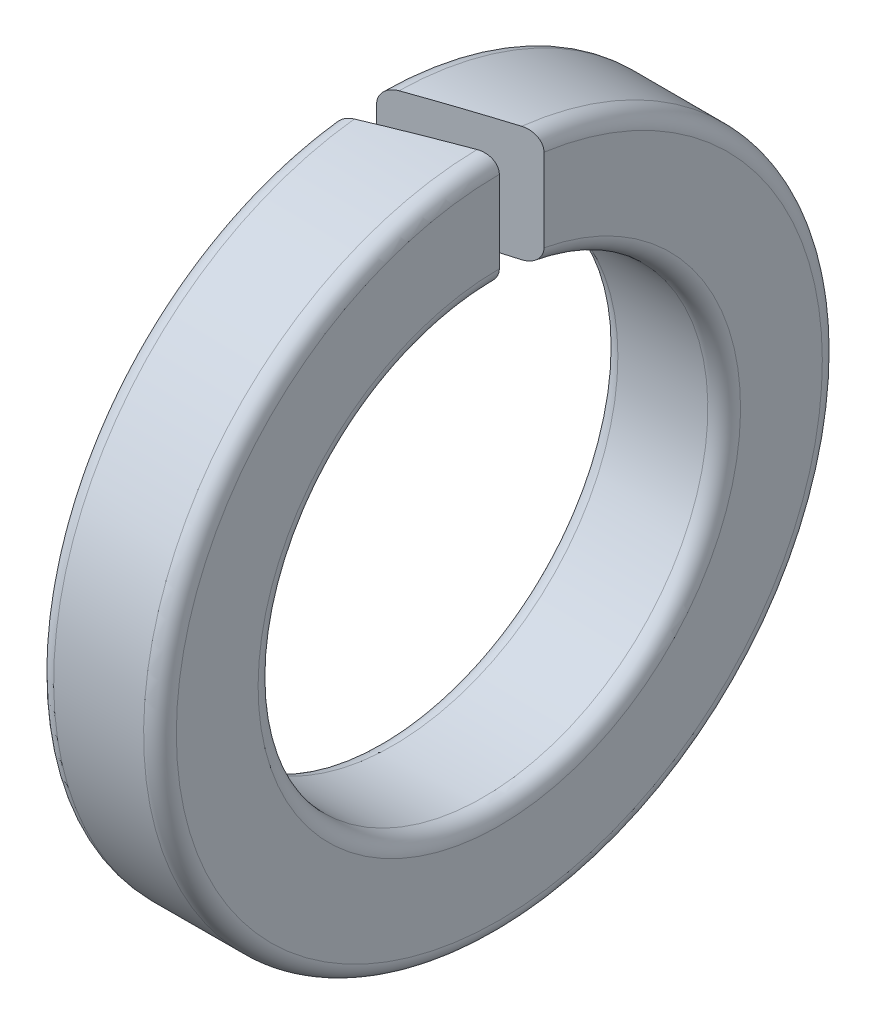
ISO-10303-21;
HEADER;
FILE_DESCRIPTION(('STEP AP214'),'2;1');
FILE_NAME('part.step','',(''),(''),'','','');
FILE_SCHEMA(('AUTOMOTIVE_DESIGN { 1 0 10303 214 1 1 1 1 }'));
ENDSEC;
DATA;
#1=APPLICATION_CONTEXT('core data for automotive mechanical design processes');
#2=APPLICATION_PROTOCOL_DEFINITION('international standard','automotive_design',2000,#1);
#3=PRODUCT_CONTEXT('',#1,'mechanical');
#4=PRODUCT('Part','Part','',(#3));
#5=PRODUCT_RELATED_PRODUCT_CATEGORY('part','',(#4));
#6=PRODUCT_DEFINITION_FORMATION('','',#4);
#7=PRODUCT_DEFINITION_CONTEXT('part definition',#1,'design');
#8=PRODUCT_DEFINITION('design','',#6,#7);
#9=PRODUCT_DEFINITION_SHAPE('','',#8);
#10=(LENGTH_UNIT() NAMED_UNIT(*) SI_UNIT(.MILLI.,.METRE.));
#11=(NAMED_UNIT(*) PLANE_ANGLE_UNIT() SI_UNIT($,.RADIAN.));
#12=(NAMED_UNIT(*) SI_UNIT($,.STERADIAN.) SOLID_ANGLE_UNIT());
#13=UNCERTAINTY_MEASURE_WITH_UNIT(LENGTH_MEASURE(1.E-05),#10,'distance_accuracy_value','');
#14=(GEOMETRIC_REPRESENTATION_CONTEXT(3) GLOBAL_UNCERTAINTY_ASSIGNED_CONTEXT((#13)) GLOBAL_UNIT_ASSIGNED_CONTEXT((#10,
#11,#12)) REPRESENTATION_CONTEXT('',''));
#15=CARTESIAN_POINT('',(0.,0.,0.));
#16=DIRECTION('',(0.,0.,1.));
#17=DIRECTION('',(1.,0.,0.));
#18=AXIS2_PLACEMENT_3D('',#15,#16,#17);
#19=CARTESIAN_POINT('',(0.,0.,-4.15));
#20=DIRECTION('',(1.,0.,0.));
#21=DIRECTION('',(0.,0.,-1.));
#22=AXIS2_PLACEMENT_3D('',#19,#20,#21);
#23=PLANE('',#22);
#24=DIRECTION('',(0.,-1.,0.));
#25=VECTOR('',#24,1.);
#26=CARTESIAN_POINT('',(0.,4.15,0.));
#27=LINE('',#26,#25);
#28=CARTESIAN_POINT('',(0.,3.95,0.));
#29=VERTEX_POINT('',#28);
#30=CARTESIAN_POINT('',(0.,2.95,0.));
#31=VERTEX_POINT('',#30);
#32=EDGE_CURVE('E206',#29,#31,#27,.T.);
#33=ORIENTED_EDGE('',*,*,#32,.F.);
#34=CARTESIAN_POINT('',(0.,0.,0.));
#35=DIRECTION('',(1.,0.,0.));
#36=DIRECTION('',(0.,0.,-1.));
#37=AXIS2_PLACEMENT_3D('',#34,#35,#36);
#38=CIRCLE('',#37,3.95);
#39=CARTESIAN_POINT('',(0.,3.91208802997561,0.545955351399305));
#40=VERTEX_POINT('',#39);
#41=EDGE_CURVE('E208',#29,#40,#38,.F.);
#42=ORIENTED_EDGE('',*,*,#41,.T.);
#43=DIRECTION('',(0.,-1.,0.));
#44=VECTOR('',#43,1.);
#45=CARTESIAN_POINT('',(0.,4.15,0.545955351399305));
#46=LINE('',#45,#44);
#47=CARTESIAN_POINT('',(0.,2.89903997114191,0.545955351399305));
#48=VERTEX_POINT('',#47);
#49=EDGE_CURVE('E104',#40,#48,#46,.T.);
#50=ORIENTED_EDGE('',*,*,#49,.T.);
#51=CARTESIAN_POINT('',(0.,0.,0.));
#52=DIRECTION('',(1.,0.,0.));
#53=DIRECTION('',(0.,0.,-1.));
#54=AXIS2_PLACEMENT_3D('',#51,#52,#53);
#55=CIRCLE('',#54,2.95);
#56=EDGE_CURVE('E49',#48,#31,#55,.T.);
#57=ORIENTED_EDGE('',*,*,#56,.T.);
#58=EDGE_LOOP('',(#33,#42,#50,#57));
#59=FACE_BOUND('',#58,.T.);
#60=ADVANCED_FACE('F35',(#59),#23,.F.);
#61=CARTESIAN_POINT('',(0.,0.,0.));
#62=DIRECTION('',(-1.,0.,0.));
#63=DIRECTION('',(0.,0.,1.));
#64=AXIS2_PLACEMENT_3D('',#61,#62,#63);
#65=CYLINDRICAL_SURFACE('',#64,2.75);
#66=CARTESIAN_POINT('',(1.5,0.,0.));
#67=DIRECTION('',(-0.342020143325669,0.,-0.939692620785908));
#68=DIRECTION('',(-0.939692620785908,0.,0.342020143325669));
#69=AXIS2_PLACEMENT_3D('',#66,#67,#68);
#70=ELLIPSE('',#69,8.04046210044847,2.75);
#71=CARTESIAN_POINT('',(1.3,2.74903638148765,0.072794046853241));
#72=VERTEX_POINT('',#71);
#73=CARTESIAN_POINT('',(0.2,2.70898844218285,0.473161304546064));
#74=VERTEX_POINT('',#73);
#75=EDGE_CURVE('E217',#72,#74,#70,.F.);
#76=ORIENTED_EDGE('',*,*,#75,.F.);
#77=CARTESIAN_POINT('',(1.3,0.,0.));
#78=DIRECTION('',(-1.,0.,0.));
#79=DIRECTION('',(0.,0.,1.));
#80=AXIS2_PLACEMENT_3D('',#77,#78,#79);
#81=CIRCLE('',#80,2.75);
#82=CARTESIAN_POINT('',(1.3,2.70898844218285,-0.473161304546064));
#83=VERTEX_POINT('',#82);
#84=EDGE_CURVE('E11',#72,#83,#81,.F.);
#85=ORIENTED_EDGE('',*,*,#84,.T.);
#86=CARTESIAN_POINT('',(0.,0.,0.));
#87=DIRECTION('',(0.34202014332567,0.,0.939692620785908));
#88=DIRECTION('',(-0.939692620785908,0.,0.342020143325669));
#89=AXIS2_PLACEMENT_3D('',#86,#87,#88);
#90=ELLIPSE('',#89,8.04046210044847,2.75);
#91=CARTESIAN_POINT('',(0.2,2.74903638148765,-0.0727940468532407));
#92=VERTEX_POINT('',#91);
#93=EDGE_CURVE('E219',#92,#83,#90,.F.);
#94=ORIENTED_EDGE('',*,*,#93,.F.);
#95=CARTESIAN_POINT('',(0.2,0.,0.));
#96=DIRECTION('',(1.,0.,0.));
#97=DIRECTION('',(0.,0.,-1.));
#98=AXIS2_PLACEMENT_3D('',#95,#96,#97);
#99=CIRCLE('',#98,2.75);
#100=EDGE_CURVE('E42',#92,#74,#99,.F.);
#101=ORIENTED_EDGE('',*,*,#100,.T.);
#102=EDGE_LOOP('',(#76,#85,#94,#101));
#103=FACE_BOUND('',#102,.T.);
#104=ADVANCED_FACE('F216',(#103),#65,.F.);
#105=CARTESIAN_POINT('',(1.5,0.,-4.15));
#106=DIRECTION('',(-1.,0.,0.));
#107=DIRECTION('',(0.,0.,1.));
#108=AXIS2_PLACEMENT_3D('',#105,#106,#107);
#109=PLANE('',#108);
#110=DIRECTION('',(0.,-1.,0.));
#111=VECTOR('',#110,1.);
#112=CARTESIAN_POINT('',(1.5,4.15,0.));
#113=LINE('',#112,#111);
#114=CARTESIAN_POINT('',(1.5,3.95,0.));
#115=VERTEX_POINT('',#114);
#116=CARTESIAN_POINT('',(1.5,2.95,0.));
#117=VERTEX_POINT('',#116);
#118=EDGE_CURVE('E201',#115,#117,#113,.T.);
#119=ORIENTED_EDGE('',*,*,#118,.F.);
#120=CARTESIAN_POINT('',(1.5,0.,0.));
#121=DIRECTION('',(-1.,0.,0.));
#122=DIRECTION('',(0.,0.,1.));
#123=AXIS2_PLACEMENT_3D('',#120,#121,#122);
#124=CIRCLE('',#123,3.95);
#125=CARTESIAN_POINT('',(1.5,3.91208802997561,-0.545955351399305));
#126=VERTEX_POINT('',#125);
#127=EDGE_CURVE('E156',#115,#126,#124,.F.);
#128=ORIENTED_EDGE('',*,*,#127,.T.);
#129=DIRECTION('',(0.,-1.,0.));
#130=VECTOR('',#129,1.);
#131=CARTESIAN_POINT('',(1.5,4.15,-0.545955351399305));
#132=LINE('',#131,#130);
#133=CARTESIAN_POINT('',(1.5,2.89903997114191,-0.545955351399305));
#134=VERTEX_POINT('',#133);
#135=EDGE_CURVE('E200',#126,#134,#132,.T.);
#136=ORIENTED_EDGE('',*,*,#135,.T.);
#137=CARTESIAN_POINT('',(1.5,0.,0.));
#138=DIRECTION('',(-1.,0.,0.));
#139=DIRECTION('',(0.,0.,1.));
#140=AXIS2_PLACEMENT_3D('',#137,#138,#139);
#141=CIRCLE('',#140,2.95);
#142=EDGE_CURVE('E190',#134,#117,#141,.T.);
#143=ORIENTED_EDGE('',*,*,#142,.T.);
#144=EDGE_LOOP('',(#119,#128,#136,#143));
#145=FACE_BOUND('',#144,.T.);
#146=ADVANCED_FACE('F199',(#145),#109,.F.);
#147=CARTESIAN_POINT('',(0.,0.,0.));
#148=DIRECTION('',(-1.,0.,0.));
#149=DIRECTION('',(0.,0.,1.));
#150=AXIS2_PLACEMENT_3D('',#147,#148,#149);
#151=CYLINDRICAL_SURFACE('',#150,4.15);
#152=CARTESIAN_POINT('',(0.,0.,0.));
#153=DIRECTION('',(0.34202014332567,0.,0.939692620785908));
#154=DIRECTION('',(-0.939692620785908,0.,0.342020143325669));
#155=AXIS2_PLACEMENT_3D('',#152,#153,#154);
#156=ELLIPSE('',#155,12.1337882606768,4.15);
#157=CARTESIAN_POINT('',(1.30000000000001,4.12293807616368,-0.473161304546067));
#158=VERTEX_POINT('',#157);
#159=CARTESIAN_POINT('',(0.200000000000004,4.14936152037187,-0.0727940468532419));
#160=VERTEX_POINT('',#159);
#161=EDGE_CURVE('E119',#158,#160,#156,.T.);
#162=ORIENTED_EDGE('',*,*,#161,.F.);
#163=CARTESIAN_POINT('',(1.3,0.,0.));
#164=DIRECTION('',(-1.,0.,0.));
#165=DIRECTION('',(0.,0.,1.));
#166=AXIS2_PLACEMENT_3D('',#163,#164,#165);
#167=CIRCLE('',#166,4.15);
#168=CARTESIAN_POINT('',(1.3,4.14936152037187,0.0727940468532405));
#169=VERTEX_POINT('',#168);
#170=EDGE_CURVE('E118',#158,#169,#167,.T.);
#171=ORIENTED_EDGE('',*,*,#170,.T.);
#172=CARTESIAN_POINT('',(1.5,0.,0.));
#173=DIRECTION('',(-0.342020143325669,0.,-0.939692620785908));
#174=DIRECTION('',(-0.939692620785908,0.,0.342020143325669));
#175=AXIS2_PLACEMENT_3D('',#172,#173,#174);
#176=ELLIPSE('',#175,12.1337882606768,4.15);
#177=CARTESIAN_POINT('',(0.2,4.12293807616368,0.473161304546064));
#178=VERTEX_POINT('',#177);
#179=EDGE_CURVE('E103',#178,#169,#176,.T.);
#180=ORIENTED_EDGE('',*,*,#179,.F.);
#181=CARTESIAN_POINT('',(0.2,0.,0.));
#182=DIRECTION('',(1.,0.,0.));
#183=DIRECTION('',(0.,0.,-1.));
#184=AXIS2_PLACEMENT_3D('',#181,#182,#183);
#185=CIRCLE('',#184,4.15);
#186=EDGE_CURVE('E116',#178,#160,#185,.T.);
#187=ORIENTED_EDGE('',*,*,#186,.T.);
#188=EDGE_LOOP('',(#162,#171,#180,#187));
#189=FACE_BOUND('',#188,.T.);
#190=ADVANCED_FACE('F115',(#189),#151,.T.);
#191=CARTESIAN_POINT('',(0.,4.15,0.));
#192=DIRECTION('',(0.34202014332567,0.,0.939692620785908));
#193=DIRECTION('',(0.939692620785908,0.,-0.34202014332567));
#194=AXIS2_PLACEMENT_3D('',#191,#192,#193);
#195=PLANE('',#194);
#196=ORIENTED_EDGE('',*,*,#135,.F.);
#197=CARTESIAN_POINT('',(1.5,3.91208802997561,-0.545955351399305));
#198=CARTESIAN_POINT('',(1.50000966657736,3.92339249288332,-0.545958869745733));
#199=CARTESIAN_POINT('',(1.4990608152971,3.93468237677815,-0.545613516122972));
#200=CARTESIAN_POINT('',(1.49537612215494,3.95689178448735,-0.544272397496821));
#201=CARTESIAN_POINT('',(1.49264601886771,3.96781237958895,-0.543278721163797));
#202=CARTESIAN_POINT('',(1.48553100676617,3.98900741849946,-0.540689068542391));
#203=CARTESIAN_POINT('',(1.48114781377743,3.99928251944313,-0.539093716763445));
#204=CARTESIAN_POINT('',(1.47089451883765,4.01895953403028,-0.535361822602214));
#205=CARTESIAN_POINT('',(1.46502348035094,4.0283608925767,-0.533224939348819));
#206=CARTESIAN_POINT('',(1.45167297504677,4.0464983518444,-0.528365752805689));
#207=CARTESIAN_POINT('',(1.44413054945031,4.05518192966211,-0.525620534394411));
#208=CARTESIAN_POINT('',(1.42784747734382,4.07116829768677,-0.519693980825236));
#209=CARTESIAN_POINT('',(1.41910642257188,4.07847061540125,-0.51651249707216));
#210=CARTESIAN_POINT('',(1.40014122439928,4.09190655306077,-0.509609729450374));
#211=CARTESIAN_POINT('',(1.38986119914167,4.09795086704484,-0.505868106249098));
#212=CARTESIAN_POINT('',(1.36851523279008,4.10817313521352,-0.498098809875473));
#213=CARTESIAN_POINT('',(1.35744967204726,4.11235198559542,-0.494071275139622));
#214=CARTESIAN_POINT('',(1.3386044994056,4.1176692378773,-0.487212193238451));
#215=CARTESIAN_POINT('',(1.33095781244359,4.11935672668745,-0.484429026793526));
#216=CARTESIAN_POINT('',(1.31554764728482,4.12182816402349,-0.478820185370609));
#217=CARTESIAN_POINT('',(1.30778434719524,4.12261337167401,-0.475994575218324));
#218=CARTESIAN_POINT('',(1.30000000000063,4.12293807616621,-0.473161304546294));
#219=B_SPLINE_CURVE_WITH_KNOTS('',3,(#197,#198,#199,#200,#201,#202,#203,#204,#205,#206,#207,
#208,#209,#210,#211,#212,#213,#214,#215,#216,#217,#218),.UNSPECIFIED.,.F.,.F.,(4,2,2,2,2,2,2,2,
2,2,4),(0.,0.0338468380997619,0.0675851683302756,0.101288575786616,0.135013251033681,
0.170333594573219,0.205665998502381,0.242994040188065,0.280304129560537,0.305189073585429,
0.330039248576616),.UNSPECIFIED.);
#220=EDGE_CURVE('E175',#126,#158,#219,.T.);
#221=ORIENTED_EDGE('',*,*,#220,.T.);
#222=ORIENTED_EDGE('',*,*,#161,.T.);
#223=CARTESIAN_POINT('',(0.2,4.14936152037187,-0.0727940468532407));
#224=CARTESIAN_POINT('',(0.188298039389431,4.14944367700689,-0.068534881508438));
#225=CARTESIAN_POINT('',(0.176588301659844,4.14847752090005,-0.0642728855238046));
#226=CARTESIAN_POINT('',(0.153469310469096,4.14449002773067,-0.0558582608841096));
#227=CARTESIAN_POINT('',(0.142060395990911,4.14146646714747,-0.0517057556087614));
#228=CARTESIAN_POINT('',(0.119873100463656,4.13340098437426,-0.0436302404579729));
#229=CARTESIAN_POINT('',(0.109095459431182,4.12835674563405,-0.0397074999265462));
#230=CARTESIAN_POINT('',(0.0885299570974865,4.11635779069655,-0.0322222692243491));
#231=CARTESIAN_POINT('',(0.0787414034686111,4.10940442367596,-0.02865952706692));
#232=CARTESIAN_POINT('',(0.0607675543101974,4.09399164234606,-0.0221175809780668));
#233=CARTESIAN_POINT('',(0.052542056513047,4.0855854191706,-0.0191237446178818));
#234=CARTESIAN_POINT('',(0.0376283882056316,4.06734189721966,-0.0136956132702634));
#235=CARTESIAN_POINT('',(0.0309402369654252,4.05750458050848,-0.0112613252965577));
#236=CARTESIAN_POINT('',(0.0196992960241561,4.03727611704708,-0.00716995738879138));
#237=CARTESIAN_POINT('',(0.0150477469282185,4.02694701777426,-0.00547693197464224));
#238=CARTESIAN_POINT('',(0.00754588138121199,4.00557964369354,-0.00274647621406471));
#239=CARTESIAN_POINT('',(0.00469296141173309,3.9945424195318,-0.00170809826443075));
#240=CARTESIAN_POINT('',(0.00186695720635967,3.9778316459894,-0.000679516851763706));
#241=CARTESIAN_POINT('',(0.00116717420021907,3.97228758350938,-0.000424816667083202));
#242=CARTESIAN_POINT('',(0.000233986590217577,3.96116334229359,-8.51641540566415E-05));
#243=CARTESIAN_POINT('',(-9.60208021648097E-08,3.95558322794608,3.4948713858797E-08));
#244=CARTESIAN_POINT('',(0.,3.95000000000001,0.));
#245=B_SPLINE_CURVE_WITH_KNOTS('',3,(#223,#224,#225,#226,#227,#228,#229,#230,#231,#232,#233,
#234,#235,#236,#237,#238,#239,#240,#241,#242,#243,#244),.UNSPECIFIED.,.F.,.F.,(4,2,2,2,2,2,2,2,
2,2,4),(0.,0.0373199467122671,0.0746802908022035,0.112083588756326,0.149460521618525,
0.185682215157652,0.221904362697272,0.256094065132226,0.290234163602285,0.306996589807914,
0.323734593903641),.UNSPECIFIED.);
#246=EDGE_CURVE('E56',#160,#29,#245,.T.);
#247=ORIENTED_EDGE('',*,*,#246,.T.);
#248=ORIENTED_EDGE('',*,*,#32,.T.);
#249=CARTESIAN_POINT('',(0.,2.95,0.));
#250=CARTESIAN_POINT('',(-1.17208001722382E-05,2.93922821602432,4.26602238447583E-06));
#251=CARTESIAN_POINT('',(0.000869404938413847,2.92846340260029,-0.000316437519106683));
#252=CARTESIAN_POINT('',(0.00432644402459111,2.90727362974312,-0.00157469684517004));
#253=CARTESIAN_POINT('',(0.00689803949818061,2.89684787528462,-0.00251068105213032));
#254=CARTESIAN_POINT('',(0.0136454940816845,2.87660562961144,-0.0049665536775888));
#255=CARTESIAN_POINT('',(0.0178211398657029,2.86678905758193,-0.00648636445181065));
#256=CARTESIAN_POINT('',(0.0276221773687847,2.84801260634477,-0.0100536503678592));
#257=CARTESIAN_POINT('',(0.0332480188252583,2.839052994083,-0.0121012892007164));
#258=CARTESIAN_POINT('',(0.0459306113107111,2.82197256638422,-0.0167173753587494));
#259=CARTESIAN_POINT('',(0.0530216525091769,2.81388064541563,-0.0192983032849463));
#260=CARTESIAN_POINT('',(0.0683124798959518,2.79898685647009,-0.0248637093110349));
#261=CARTESIAN_POINT('',(0.076512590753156,2.79218536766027,-0.0278483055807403));
#262=CARTESIAN_POINT('',(0.0943342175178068,2.77961211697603,-0.0343348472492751));
#263=CARTESIAN_POINT('',(0.104012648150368,2.7739317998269,-0.0378575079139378));
#264=CARTESIAN_POINT('',(0.124090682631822,2.76426518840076,-0.0451653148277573));
#265=CARTESIAN_POINT('',(0.134490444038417,2.76027926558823,-0.0489505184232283));
#266=CARTESIAN_POINT('',(0.154052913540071,2.7545588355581,-0.0560706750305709));
#267=CARTESIAN_POINT('',(0.163150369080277,2.75256758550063,-0.0593818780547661));
#268=CARTESIAN_POINT('',(0.181496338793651,2.74985122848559,-0.0660592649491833));
#269=CARTESIAN_POINT('',(0.190744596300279,2.74912415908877,-0.069425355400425));
#270=CARTESIAN_POINT('',(0.2,2.74903638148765,-0.0727940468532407));
#271=B_SPLINE_CURVE_WITH_KNOTS('',3,(#249,#250,#251,#252,#253,#254,#255,#256,#257,#258,#259,
#260,#261,#262,#263,#264,#265,#266,#267,#268,#269,#270),.UNSPECIFIED.,.F.,.F.,(4,2,2,2,2,2,2,2,
2,2,4),(0.,0.0322638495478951,0.0644456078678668,0.0966230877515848,0.12881055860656,
0.161860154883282,0.194919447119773,0.230054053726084,0.265196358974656,0.294767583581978,
0.324292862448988),.UNSPECIFIED.);
#272=EDGE_CURVE('E149',#31,#92,#271,.T.);
#273=ORIENTED_EDGE('',*,*,#272,.T.);
#274=ORIENTED_EDGE('',*,*,#93,.T.);
#275=CARTESIAN_POINT('',(1.3,2.70898844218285,-0.473161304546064));
#276=CARTESIAN_POINT('',(1.31126923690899,2.70826441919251,-0.47726297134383));
#277=CARTESIAN_POINT('',(1.32260425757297,2.70850884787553,-0.481388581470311));
#278=CARTESIAN_POINT('',(1.34511715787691,2.71097147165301,-0.489582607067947));
#279=CARTESIAN_POINT('',(1.35629444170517,2.71319578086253,-0.493650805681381));
#280=CARTESIAN_POINT('',(1.37815677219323,2.71966808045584,-0.501608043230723));
#281=CARTESIAN_POINT('',(1.38884050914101,2.72392115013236,-0.505496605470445));
#282=CARTESIAN_POINT('',(1.4093015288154,2.73440270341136,-0.512943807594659));
#283=CARTESIAN_POINT('',(1.41908018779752,2.74062812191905,-0.516502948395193));
#284=CARTESIAN_POINT('',(1.43678078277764,2.75445843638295,-0.522945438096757));
#285=CARTESIAN_POINT('',(1.44478171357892,2.76194875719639,-0.525857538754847));
#286=CARTESIAN_POINT('',(1.45938534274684,2.77834355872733,-0.531172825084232));
#287=CARTESIAN_POINT('',(1.46598826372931,2.78724781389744,-0.53357609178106));
#288=CARTESIAN_POINT('',(1.47717939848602,2.80557203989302,-0.537649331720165));
#289=CARTESIAN_POINT('',(1.48187046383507,2.81492116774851,-0.539356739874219));
#290=CARTESIAN_POINT('',(1.48968510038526,2.83433429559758,-0.542201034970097));
#291=CARTESIAN_POINT('',(1.49280908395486,2.84439810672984,-0.543338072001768));
#292=CARTESIAN_POINT('',(1.49674800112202,2.86193049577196,-0.544771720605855));
#293=CARTESIAN_POINT('',(1.49797079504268,2.86929892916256,-0.545216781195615));
#294=CARTESIAN_POINT('',(1.49959694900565,2.88412459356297,-0.545808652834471));
#295=CARTESIAN_POINT('',(1.50000174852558,2.89158164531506,-0.545955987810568));
#296=CARTESIAN_POINT('',(1.50000000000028,2.89903997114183,-0.545955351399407));
#297=B_SPLINE_CURVE_WITH_KNOTS('',3,(#275,#276,#277,#278,#279,#280,#281,#282,#283,#284,#285,
#286,#287,#288,#289,#290,#291,#292,#293,#294,#295,#296),.UNSPECIFIED.,.F.,.F.,(4,2,2,2,2,2,2,2,
2,2,4),(0.,0.036023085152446,0.0721578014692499,0.108383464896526,0.144553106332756,
0.178394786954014,0.212231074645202,0.243874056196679,0.275508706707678,0.297907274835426,
0.320266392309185),.UNSPECIFIED.);
#298=EDGE_CURVE('E155',#83,#134,#297,.T.);
#299=ORIENTED_EDGE('',*,*,#298,.T.);
#300=EDGE_LOOP('',(#196,#221,#222,#247,#248,#273,#274,#299));
#301=FACE_BOUND('',#300,.T.);
#302=ADVANCED_FACE('F162',(#301),#195,.T.);
#303=CARTESIAN_POINT('',(1.5,4.15,0.));
#304=DIRECTION('',(-0.342020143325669,0.,-0.939692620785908));
#305=DIRECTION('',(-0.939692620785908,0.,0.342020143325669));
#306=AXIS2_PLACEMENT_3D('',#303,#304,#305);
#307=PLANE('',#306);
#308=ORIENTED_EDGE('',*,*,#179,.T.);
#309=CARTESIAN_POINT('',(1.3,4.14936152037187,0.0727940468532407));
#310=CARTESIAN_POINT('',(1.31170196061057,4.14944367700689,0.0685348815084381));
#311=CARTESIAN_POINT('',(1.32341169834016,4.14847752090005,0.0642728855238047));
#312=CARTESIAN_POINT('',(1.3465306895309,4.14449002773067,0.0558582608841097));
#313=CARTESIAN_POINT('',(1.35793960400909,4.14146646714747,0.0517057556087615));
#314=CARTESIAN_POINT('',(1.38012689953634,4.13340098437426,0.043630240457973));
#315=CARTESIAN_POINT('',(1.39090454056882,4.12835674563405,0.0397074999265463));
#316=CARTESIAN_POINT('',(1.41147004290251,4.11635779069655,0.0322222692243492));
#317=CARTESIAN_POINT('',(1.42125859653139,4.10940442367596,0.0286595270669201));
#318=CARTESIAN_POINT('',(1.4392324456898,4.09399164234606,0.0221175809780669));
#319=CARTESIAN_POINT('',(1.44745794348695,4.0855854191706,0.0191237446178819));
#320=CARTESIAN_POINT('',(1.46237161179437,4.06734189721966,0.0136956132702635));
#321=CARTESIAN_POINT('',(1.46905976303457,4.05750458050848,0.0112613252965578));
#322=CARTESIAN_POINT('',(1.48030070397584,4.03727611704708,0.00716995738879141));
#323=CARTESIAN_POINT('',(1.48495225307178,4.02694701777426,0.00547693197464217));
#324=CARTESIAN_POINT('',(1.49245411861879,4.00557964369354,0.00274647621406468));
#325=CARTESIAN_POINT('',(1.49530703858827,3.99454241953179,0.00170809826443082));
#326=CARTESIAN_POINT('',(1.49813304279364,3.9778316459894,0.00067951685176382));
#327=CARTESIAN_POINT('',(1.49883282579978,3.97228758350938,0.00042481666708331));
#328=CARTESIAN_POINT('',(1.49976601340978,3.96116334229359,8.51641540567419E-05));
#329=CARTESIAN_POINT('',(1.5000000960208,3.95558322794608,-3.49487137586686E-08));
#330=CARTESIAN_POINT('',(1.50000000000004,3.95000000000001,0.));
#331=B_SPLINE_CURVE_WITH_KNOTS('',3,(#309,#310,#311,#312,#313,#314,#315,#316,#317,#318,#319,
#320,#321,#322,#323,#324,#325,#326,#327,#328,#329,#330),.UNSPECIFIED.,.F.,.F.,(4,2,2,2,2,2,2,2,
2,2,4),(0.,0.037319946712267,0.0746802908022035,0.112083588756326,0.149460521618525,
0.185682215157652,0.221904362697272,0.256094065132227,0.290234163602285,0.306996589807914,
0.323734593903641),.UNSPECIFIED.);
#332=EDGE_CURVE('E109',#169,#115,#331,.T.);
#333=ORIENTED_EDGE('',*,*,#332,.T.);
#334=ORIENTED_EDGE('',*,*,#118,.T.);
#335=CARTESIAN_POINT('',(1.5,2.95,0.));
#336=CARTESIAN_POINT('',(1.50001172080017,2.93922821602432,-4.26602238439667E-06));
#337=CARTESIAN_POINT('',(1.49913059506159,2.92846340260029,0.000316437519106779));
#338=CARTESIAN_POINT('',(1.49567355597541,2.90727362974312,0.00157469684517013));
#339=CARTESIAN_POINT('',(1.49310196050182,2.89684787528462,0.00251068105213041));
#340=CARTESIAN_POINT('',(1.48635450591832,2.87660562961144,0.0049665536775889));
#341=CARTESIAN_POINT('',(1.4821788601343,2.86678905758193,0.00648636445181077));
#342=CARTESIAN_POINT('',(1.47237782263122,2.84801260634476,0.0100536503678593));
#343=CARTESIAN_POINT('',(1.46675198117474,2.839052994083,0.0121012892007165));
#344=CARTESIAN_POINT('',(1.45406938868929,2.82197256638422,0.0167173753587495));
#345=CARTESIAN_POINT('',(1.44697834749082,2.81388064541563,0.0192983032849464));
#346=CARTESIAN_POINT('',(1.43168752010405,2.79898685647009,0.024863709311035));
#347=CARTESIAN_POINT('',(1.42348740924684,2.79218536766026,0.0278483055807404));
#348=CARTESIAN_POINT('',(1.40566578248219,2.77961211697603,0.0343348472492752));
#349=CARTESIAN_POINT('',(1.39598735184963,2.7739317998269,0.0378575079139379));
#350=CARTESIAN_POINT('',(1.37590931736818,2.76426518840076,0.0451653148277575));
#351=CARTESIAN_POINT('',(1.36550955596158,2.76027926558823,0.0489505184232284));
#352=CARTESIAN_POINT('',(1.34594708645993,2.7545588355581,0.0560706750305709));
#353=CARTESIAN_POINT('',(1.33684963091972,2.75256758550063,0.0593818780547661));
#354=CARTESIAN_POINT('',(1.31850366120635,2.74985122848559,0.0660592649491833));
#355=CARTESIAN_POINT('',(1.30925540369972,2.74912415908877,0.069425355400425));
#356=CARTESIAN_POINT('',(1.3,2.74903638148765,0.0727940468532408));
#357=B_SPLINE_CURVE_WITH_KNOTS('',3,(#335,#336,#337,#338,#339,#340,#341,#342,#343,#344,#345,
#346,#347,#348,#349,#350,#351,#352,#353,#354,#355,#356),.UNSPECIFIED.,.F.,.F.,(4,2,2,2,2,2,2,2,
2,2,4),(0.,0.0322638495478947,0.0644456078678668,0.0966230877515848,0.128810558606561,
0.161860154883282,0.194919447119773,0.230054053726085,0.265196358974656,0.294767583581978,
0.324292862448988),.UNSPECIFIED.);
#358=EDGE_CURVE('E110',#117,#72,#357,.T.);
#359=ORIENTED_EDGE('',*,*,#358,.T.);
#360=ORIENTED_EDGE('',*,*,#75,.T.);
#361=CARTESIAN_POINT('',(0.2,2.70898844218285,0.473161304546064));
#362=CARTESIAN_POINT('',(0.188730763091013,2.70826441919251,0.47726297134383));
#363=CARTESIAN_POINT('',(0.177395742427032,2.70850884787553,0.481388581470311));
#364=CARTESIAN_POINT('',(0.154882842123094,2.71097147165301,0.489582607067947));
#365=CARTESIAN_POINT('',(0.143705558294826,2.71319578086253,0.493650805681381));
#366=CARTESIAN_POINT('',(0.121843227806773,2.71966808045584,0.501608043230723));
#367=CARTESIAN_POINT('',(0.111159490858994,2.72392115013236,0.505496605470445));
#368=CARTESIAN_POINT('',(0.0906984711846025,2.73440270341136,0.512943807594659));
#369=CARTESIAN_POINT('',(0.0809198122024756,2.74062812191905,0.516502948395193));
#370=CARTESIAN_POINT('',(0.0632192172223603,2.75445843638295,0.522945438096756));
#371=CARTESIAN_POINT('',(0.055218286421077,2.76194875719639,0.525857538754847));
#372=CARTESIAN_POINT('',(0.0406146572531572,2.77834355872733,0.531172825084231));
#373=CARTESIAN_POINT('',(0.0340117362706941,2.78724781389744,0.53357609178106));
#374=CARTESIAN_POINT('',(0.0228206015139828,2.80557203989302,0.537649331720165));
#375=CARTESIAN_POINT('',(0.018129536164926,2.81492116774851,0.539356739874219));
#376=CARTESIAN_POINT('',(0.0103148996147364,2.83433429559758,0.542201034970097));
#377=CARTESIAN_POINT('',(0.00719091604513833,2.84439810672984,0.543338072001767));
#378=CARTESIAN_POINT('',(0.0032519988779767,2.86193049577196,0.544771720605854));
#379=CARTESIAN_POINT('',(0.00202920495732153,2.86929892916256,0.545216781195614));
#380=CARTESIAN_POINT('',(0.000403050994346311,2.88412459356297,0.545808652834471));
#381=CARTESIAN_POINT('',(-1.74852557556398E-06,2.89158164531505,0.545955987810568));
#382=CARTESIAN_POINT('',(-2.79784474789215E-13,2.89903997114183,0.545955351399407));
#383=B_SPLINE_CURVE_WITH_KNOTS('',3,(#361,#362,#363,#364,#365,#366,#367,#368,#369,#370,#371,
#372,#373,#374,#375,#376,#377,#378,#379,#380,#381,#382),.UNSPECIFIED.,.F.,.F.,(4,2,2,2,2,2,2,2,
2,2,4),(0.,0.036023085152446,0.0721578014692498,0.108383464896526,0.144553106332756,
0.178394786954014,0.212231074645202,0.243874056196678,0.275508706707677,0.297907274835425,
0.320266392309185),.UNSPECIFIED.);
#384=EDGE_CURVE('E123',#74,#48,#383,.T.);
#385=ORIENTED_EDGE('',*,*,#384,.T.);
#386=ORIENTED_EDGE('',*,*,#49,.F.);
#387=CARTESIAN_POINT('',(0.,3.91208802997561,0.545955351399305));
#388=CARTESIAN_POINT('',(-9.6665773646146E-06,3.92339249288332,0.545958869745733));
#389=CARTESIAN_POINT('',(0.000939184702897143,3.93468237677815,0.545613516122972));
#390=CARTESIAN_POINT('',(0.00462387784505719,3.95689178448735,0.544272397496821));
#391=CARTESIAN_POINT('',(0.00735398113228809,3.96781237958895,0.543278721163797));
#392=CARTESIAN_POINT('',(0.0144689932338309,3.98900741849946,0.540689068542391));
#393=CARTESIAN_POINT('',(0.0188521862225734,3.99928251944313,0.539093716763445));
#394=CARTESIAN_POINT('',(0.0291054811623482,4.01895953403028,0.535361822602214));
#395=CARTESIAN_POINT('',(0.0349765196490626,4.0283608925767,0.533224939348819));
#396=CARTESIAN_POINT('',(0.0483270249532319,4.0464983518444,0.528365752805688));
#397=CARTESIAN_POINT('',(0.0558694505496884,4.05518192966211,0.525620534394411));
#398=CARTESIAN_POINT('',(0.0721525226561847,4.07116829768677,0.519693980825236));
#399=CARTESIAN_POINT('',(0.0808935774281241,4.07847061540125,0.516512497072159));
#400=CARTESIAN_POINT('',(0.0998587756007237,4.09190655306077,0.509609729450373));
#401=CARTESIAN_POINT('',(0.110138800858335,4.09795086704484,0.505868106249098));
#402=CARTESIAN_POINT('',(0.13148476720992,4.10817313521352,0.498098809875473));
#403=CARTESIAN_POINT('',(0.142550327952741,4.11235198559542,0.494071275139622));
#404=CARTESIAN_POINT('',(0.161395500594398,4.1176692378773,0.487212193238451));
#405=CARTESIAN_POINT('',(0.169042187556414,4.11935672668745,0.484429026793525));
#406=CARTESIAN_POINT('',(0.184452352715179,4.12182816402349,0.478820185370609));
#407=CARTESIAN_POINT('',(0.192215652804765,4.12261337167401,0.475994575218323));
#408=CARTESIAN_POINT('',(0.19999999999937,4.12293807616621,0.473161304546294));
#409=B_SPLINE_CURVE_WITH_KNOTS('',3,(#387,#388,#389,#390,#391,#392,#393,#394,#395,#396,#397,
#398,#399,#400,#401,#402,#403,#404,#405,#406,#407,#408),.UNSPECIFIED.,.F.,.F.,(4,2,2,2,2,2,2,2,
2,2,4),(0.,0.0338468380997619,0.0675851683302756,0.101288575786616,0.13501325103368,
0.170333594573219,0.205665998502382,0.242994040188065,0.280304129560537,0.305189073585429,
0.330039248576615),.UNSPECIFIED.);
#410=EDGE_CURVE('E100',#40,#178,#409,.T.);
#411=ORIENTED_EDGE('',*,*,#410,.T.);
#412=EDGE_LOOP('',(#308,#333,#334,#359,#360,#385,#386,#411));
#413=FACE_BOUND('',#412,.T.);
#414=ADVANCED_FACE('F102',(#413),#307,.T.);
#415=CARTESIAN_POINT('',(1.3,0.,0.));
#416=DIRECTION('',(-1.,0.,0.));
#417=DIRECTION('',(0.,0.,1.));
#418=AXIS2_PLACEMENT_3D('',#415,#416,#417);
#419=TOROIDAL_SURFACE('',#418,3.95,0.2);
#420=ORIENTED_EDGE('',*,*,#220,.F.);
#421=ORIENTED_EDGE('',*,*,#127,.F.);
#422=ORIENTED_EDGE('',*,*,#332,.F.);
#423=ORIENTED_EDGE('',*,*,#170,.F.);
#424=EDGE_LOOP('',(#420,#421,#422,#423));
#425=FACE_BOUND('',#424,.T.);
#426=ADVANCED_FACE('F166',(#425),#419,.T.);
#427=CARTESIAN_POINT('',(0.2,0.,0.));
#428=DIRECTION('',(1.,0.,0.));
#429=DIRECTION('',(0.,0.,-1.));
#430=AXIS2_PLACEMENT_3D('',#427,#428,#429);
#431=TOROIDAL_SURFACE('',#430,3.95,0.2);
#432=ORIENTED_EDGE('',*,*,#246,.F.);
#433=ORIENTED_EDGE('',*,*,#186,.F.);
#434=ORIENTED_EDGE('',*,*,#410,.F.);
#435=ORIENTED_EDGE('',*,*,#41,.F.);
#436=EDGE_LOOP('',(#432,#433,#434,#435));
#437=FACE_BOUND('',#436,.T.);
#438=ADVANCED_FACE('F121',(#437),#431,.T.);
#439=CARTESIAN_POINT('',(1.3,0.,0.));
#440=DIRECTION('',(-1.,0.,0.));
#441=DIRECTION('',(0.,0.,1.));
#442=AXIS2_PLACEMENT_3D('',#439,#440,#441);
#443=TOROIDAL_SURFACE('',#442,2.95,0.2);
#444=ORIENTED_EDGE('',*,*,#298,.F.);
#445=ORIENTED_EDGE('',*,*,#84,.F.);
#446=ORIENTED_EDGE('',*,*,#358,.F.);
#447=ORIENTED_EDGE('',*,*,#142,.F.);
#448=EDGE_LOOP('',(#444,#445,#446,#447));
#449=FACE_BOUND('',#448,.T.);
#450=ADVANCED_FACE('F143',(#449),#443,.T.);
#451=CARTESIAN_POINT('',(0.2,0.,0.));
#452=DIRECTION('',(1.,0.,0.));
#453=DIRECTION('',(0.,0.,-1.));
#454=AXIS2_PLACEMENT_3D('',#451,#452,#453);
#455=TOROIDAL_SURFACE('',#454,2.95,0.2);
#456=ORIENTED_EDGE('',*,*,#272,.F.);
#457=ORIENTED_EDGE('',*,*,#56,.F.);
#458=ORIENTED_EDGE('',*,*,#384,.F.);
#459=ORIENTED_EDGE('',*,*,#100,.F.);
#460=EDGE_LOOP('',(#456,#457,#458,#459));
#461=FACE_BOUND('',#460,.T.);
#462=ADVANCED_FACE('F140',(#461),#455,.T.);
#463=CLOSED_SHELL('',(#60,#104,#146,#190,#302,#414,#426,#438,#450,#462));
#464=MANIFOLD_SOLID_BREP('B2',#463);
#465=ADVANCED_BREP_SHAPE_REPRESENTATION('',(#18,#464),#14);
#466=SHAPE_DEFINITION_REPRESENTATION(#9,#465);
ENDSEC;
END-ISO-10303-21;
